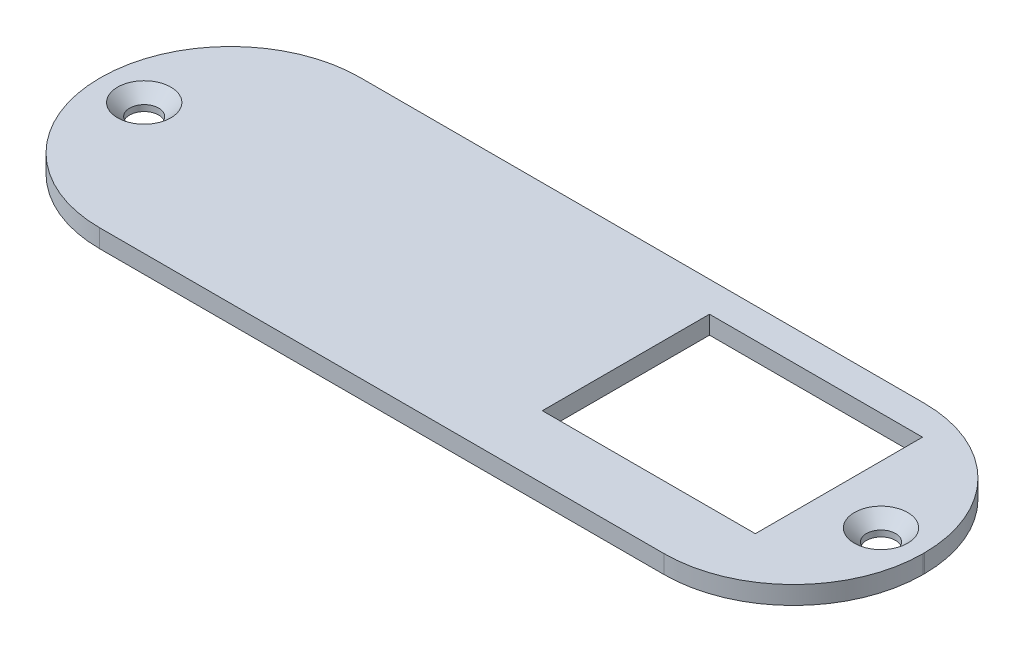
ISO-10303-21;
HEADER;
FILE_DESCRIPTION(('STEP AP214'),'2;1');
FILE_NAME('part.step','',(''),(''),'','','');
FILE_SCHEMA(('AUTOMOTIVE_DESIGN { 1 0 10303 214 1 1 1 1 }'));
ENDSEC;
DATA;
#1=APPLICATION_CONTEXT('core data for automotive mechanical design processes');
#2=APPLICATION_PROTOCOL_DEFINITION('international standard','automotive_design',2000,#1);
#3=PRODUCT_CONTEXT('',#1,'mechanical');
#4=PRODUCT('Part','Part','',(#3));
#5=PRODUCT_RELATED_PRODUCT_CATEGORY('part','',(#4));
#6=PRODUCT_DEFINITION_FORMATION('','',#4);
#7=PRODUCT_DEFINITION_CONTEXT('part definition',#1,'design');
#8=PRODUCT_DEFINITION('design','',#6,#7);
#9=PRODUCT_DEFINITION_SHAPE('','',#8);
#10=(LENGTH_UNIT() NAMED_UNIT(*) SI_UNIT(.MILLI.,.METRE.));
#11=(NAMED_UNIT(*) PLANE_ANGLE_UNIT() SI_UNIT($,.RADIAN.));
#12=(NAMED_UNIT(*) SI_UNIT($,.STERADIAN.) SOLID_ANGLE_UNIT());
#13=UNCERTAINTY_MEASURE_WITH_UNIT(LENGTH_MEASURE(1.E-05),#10,'distance_accuracy_value','');
#14=(GEOMETRIC_REPRESENTATION_CONTEXT(3) GLOBAL_UNCERTAINTY_ASSIGNED_CONTEXT((#13)) GLOBAL_UNIT_ASSIGNED_CONTEXT((#10,
#11,#12)) REPRESENTATION_CONTEXT('',''));
#15=CARTESIAN_POINT('',(0.,0.,0.));
#16=DIRECTION('',(0.,0.,1.));
#17=DIRECTION('',(1.,0.,0.));
#18=AXIS2_PLACEMENT_3D('',#15,#16,#17);
#19=CARTESIAN_POINT('',(10.7,1.5,-10.7));
#20=DIRECTION('',(0.,-1.,0.));
#21=DIRECTION('',(0.,0.,-1.));
#22=AXIS2_PLACEMENT_3D('',#19,#20,#21);
#23=CYLINDRICAL_SURFACE('',#22,10.7);
#24=CARTESIAN_POINT('',(10.7,0.,-10.7));
#25=DIRECTION('',(0.,1.,0.));
#26=DIRECTION('',(0.,0.,-1.));
#27=AXIS2_PLACEMENT_3D('',#24,#25,#26);
#28=CIRCLE('',#27,10.7);
#29=CARTESIAN_POINT('',(0.,0.,-10.7000000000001));
#30=VERTEX_POINT('',#29);
#31=CARTESIAN_POINT('',(10.7000000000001,0.,0.));
#32=VERTEX_POINT('',#31);
#33=EDGE_CURVE('E199',#30,#32,#28,.T.);
#34=ORIENTED_EDGE('',*,*,#33,.T.);
#35=DIRECTION('',(0.,-1.,0.));
#36=VECTOR('',#35,1.);
#37=CARTESIAN_POINT('',(10.7000000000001,1.5,0.));
#38=LINE('',#37,#36);
#39=CARTESIAN_POINT('',(10.7000000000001,1.5,0.));
#40=VERTEX_POINT('',#39);
#41=EDGE_CURVE('E11',#40,#32,#38,.T.);
#42=ORIENTED_EDGE('',*,*,#41,.F.);
#43=CARTESIAN_POINT('',(10.7,1.5,-10.7));
#44=DIRECTION('',(0.,1.,0.));
#45=DIRECTION('',(0.,0.,-1.));
#46=AXIS2_PLACEMENT_3D('',#43,#44,#45);
#47=CIRCLE('',#46,10.7);
#48=CARTESIAN_POINT('',(0.,1.5,-10.7000000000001));
#49=VERTEX_POINT('',#48);
#50=EDGE_CURVE('E200',#49,#40,#47,.T.);
#51=ORIENTED_EDGE('',*,*,#50,.F.);
#52=DIRECTION('',(0.,-1.,0.));
#53=VECTOR('',#52,1.);
#54=CARTESIAN_POINT('',(0.,1.5,-10.7000000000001));
#55=LINE('',#54,#53);
#56=EDGE_CURVE('E226',#49,#30,#55,.T.);
#57=ORIENTED_EDGE('',*,*,#56,.T.);
#58=EDGE_LOOP('',(#34,#42,#51,#57));
#59=FACE_BOUND('',#58,.T.);
#60=ADVANCED_FACE('F38',(#59),#23,.T.);
#61=CARTESIAN_POINT('',(10.7000000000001,1.5,0.));
#62=DIRECTION('',(0.,0.,-1.));
#63=DIRECTION('',(-1.,0.,0.));
#64=AXIS2_PLACEMENT_3D('',#61,#62,#63);
#65=PLANE('',#64);
#66=DIRECTION('',(1.,0.,0.));
#67=VECTOR('',#66,1.);
#68=CARTESIAN_POINT('',(10.7000000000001,0.,0.));
#69=LINE('',#68,#67);
#70=CARTESIAN_POINT('',(57.2999999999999,0.,0.));
#71=VERTEX_POINT('',#70);
#72=EDGE_CURVE('E230',#32,#71,#69,.T.);
#73=ORIENTED_EDGE('',*,*,#72,.T.);
#74=DIRECTION('',(0.,-1.,0.));
#75=VECTOR('',#74,1.);
#76=CARTESIAN_POINT('',(57.2999999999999,1.5,0.));
#77=LINE('',#76,#75);
#78=CARTESIAN_POINT('',(57.2999999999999,1.5,0.));
#79=VERTEX_POINT('',#78);
#80=EDGE_CURVE('E46',#79,#71,#77,.T.);
#81=ORIENTED_EDGE('',*,*,#80,.F.);
#82=DIRECTION('',(1.,0.,0.));
#83=VECTOR('',#82,1.);
#84=CARTESIAN_POINT('',(10.7000000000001,1.5,0.));
#85=LINE('',#84,#83);
#86=EDGE_CURVE('E204',#40,#79,#85,.T.);
#87=ORIENTED_EDGE('',*,*,#86,.F.);
#88=ORIENTED_EDGE('',*,*,#41,.T.);
#89=EDGE_LOOP('',(#73,#81,#87,#88));
#90=FACE_BOUND('',#89,.T.);
#91=ADVANCED_FACE('F300',(#90),#65,.F.);
#92=CARTESIAN_POINT('',(57.3,1.5,-10.7));
#93=DIRECTION('',(0.,-1.,0.));
#94=DIRECTION('',(0.,0.,-1.));
#95=AXIS2_PLACEMENT_3D('',#92,#93,#94);
#96=CYLINDRICAL_SURFACE('',#95,10.7);
#97=CARTESIAN_POINT('',(57.3,0.,-10.7));
#98=DIRECTION('',(0.,1.,0.));
#99=DIRECTION('',(0.,0.,1.));
#100=AXIS2_PLACEMENT_3D('',#97,#98,#99);
#101=CIRCLE('',#100,10.7);
#102=CARTESIAN_POINT('',(68.,0.,-10.7000000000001));
#103=VERTEX_POINT('',#102);
#104=EDGE_CURVE('E233',#71,#103,#101,.T.);
#105=ORIENTED_EDGE('',*,*,#104,.T.);
#106=DIRECTION('',(0.,-1.,0.));
#107=VECTOR('',#106,1.);
#108=CARTESIAN_POINT('',(68.,1.5,-10.7000000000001));
#109=LINE('',#108,#107);
#110=CARTESIAN_POINT('',(68.,1.5,-10.7000000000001));
#111=VERTEX_POINT('',#110);
#112=EDGE_CURVE('E269',#111,#103,#109,.T.);
#113=ORIENTED_EDGE('',*,*,#112,.F.);
#114=CARTESIAN_POINT('',(57.3,1.5,-10.7));
#115=DIRECTION('',(0.,1.,0.));
#116=DIRECTION('',(0.,0.,1.));
#117=AXIS2_PLACEMENT_3D('',#114,#115,#116);
#118=CIRCLE('',#117,10.7);
#119=EDGE_CURVE('E208',#79,#111,#118,.T.);
#120=ORIENTED_EDGE('',*,*,#119,.F.);
#121=ORIENTED_EDGE('',*,*,#80,.T.);
#122=EDGE_LOOP('',(#105,#113,#120,#121));
#123=FACE_BOUND('',#122,.T.);
#124=ADVANCED_FACE('F278',(#123),#96,.T.);
#125=CARTESIAN_POINT('',(68.,1.5,-10.7000000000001));
#126=DIRECTION('',(-1.,0.,0.));
#127=DIRECTION('',(0.,0.,1.));
#128=AXIS2_PLACEMENT_3D('',#125,#126,#127);
#129=PLANE('',#128);
#130=DIRECTION('',(0.,0.,-1.));
#131=VECTOR('',#130,1.);
#132=CARTESIAN_POINT('',(68.,0.,-10.7000000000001));
#133=LINE('',#132,#131);
#134=CARTESIAN_POINT('',(68.,0.,-10.7999999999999));
#135=VERTEX_POINT('',#134);
#136=EDGE_CURVE('E236',#103,#135,#133,.T.);
#137=ORIENTED_EDGE('',*,*,#136,.T.);
#138=DIRECTION('',(0.,-1.,0.));
#139=VECTOR('',#138,1.);
#140=CARTESIAN_POINT('',(68.,1.5,-10.7999999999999));
#141=LINE('',#140,#139);
#142=CARTESIAN_POINT('',(68.,1.5,-10.7999999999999));
#143=VERTEX_POINT('',#142);
#144=EDGE_CURVE('E265',#143,#135,#141,.T.);
#145=ORIENTED_EDGE('',*,*,#144,.F.);
#146=DIRECTION('',(0.,0.,-1.));
#147=VECTOR('',#146,1.);
#148=CARTESIAN_POINT('',(68.,1.5,-10.7000000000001));
#149=LINE('',#148,#147);
#150=EDGE_CURVE('E211',#111,#143,#149,.T.);
#151=ORIENTED_EDGE('',*,*,#150,.F.);
#152=ORIENTED_EDGE('',*,*,#112,.T.);
#153=EDGE_LOOP('',(#137,#145,#151,#152));
#154=FACE_BOUND('',#153,.T.);
#155=ADVANCED_FACE('F288',(#154),#129,.F.);
#156=CARTESIAN_POINT('',(57.3,1.5,-10.8));
#157=DIRECTION('',(0.,-1.,0.));
#158=DIRECTION('',(0.,0.,-1.));
#159=AXIS2_PLACEMENT_3D('',#156,#157,#158);
#160=CYLINDRICAL_SURFACE('',#159,10.7);
#161=CARTESIAN_POINT('',(57.3,0.,-10.8));
#162=DIRECTION('',(0.,1.,0.));
#163=DIRECTION('',(0.,0.,-1.));
#164=AXIS2_PLACEMENT_3D('',#161,#162,#163);
#165=CIRCLE('',#164,10.7);
#166=CARTESIAN_POINT('',(57.2999999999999,0.,-21.5));
#167=VERTEX_POINT('',#166);
#168=EDGE_CURVE('E239',#135,#167,#165,.T.);
#169=ORIENTED_EDGE('',*,*,#168,.T.);
#170=DIRECTION('',(0.,-1.,0.));
#171=VECTOR('',#170,1.);
#172=CARTESIAN_POINT('',(57.2999999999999,1.5,-21.5));
#173=LINE('',#172,#171);
#174=CARTESIAN_POINT('',(57.2999999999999,1.5,-21.5));
#175=VERTEX_POINT('',#174);
#176=EDGE_CURVE('E261',#175,#167,#173,.T.);
#177=ORIENTED_EDGE('',*,*,#176,.F.);
#178=CARTESIAN_POINT('',(57.3,1.5,-10.8));
#179=DIRECTION('',(0.,1.,0.));
#180=DIRECTION('',(0.,0.,-1.));
#181=AXIS2_PLACEMENT_3D('',#178,#179,#180);
#182=CIRCLE('',#181,10.7);
#183=EDGE_CURVE('E214',#143,#175,#182,.T.);
#184=ORIENTED_EDGE('',*,*,#183,.F.);
#185=ORIENTED_EDGE('',*,*,#144,.T.);
#186=EDGE_LOOP('',(#169,#177,#184,#185));
#187=FACE_BOUND('',#186,.T.);
#188=ADVANCED_FACE('F292',(#187),#160,.T.);
#189=CARTESIAN_POINT('',(10.7000000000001,1.5,-21.5));
#190=DIRECTION('',(0.,0.,1.));
#191=DIRECTION('',(1.,0.,0.));
#192=AXIS2_PLACEMENT_3D('',#189,#190,#191);
#193=PLANE('',#192);
#194=DIRECTION('',(-1.,0.,0.));
#195=VECTOR('',#194,1.);
#196=CARTESIAN_POINT('',(10.7000000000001,0.,-21.5));
#197=LINE('',#196,#195);
#198=CARTESIAN_POINT('',(10.7000000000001,0.,-21.5));
#199=VERTEX_POINT('',#198);
#200=EDGE_CURVE('E242',#167,#199,#197,.T.);
#201=ORIENTED_EDGE('',*,*,#200,.T.);
#202=DIRECTION('',(0.,-1.,0.));
#203=VECTOR('',#202,1.);
#204=CARTESIAN_POINT('',(10.7000000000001,1.5,-21.5));
#205=LINE('',#204,#203);
#206=CARTESIAN_POINT('',(10.7000000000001,1.5,-21.5));
#207=VERTEX_POINT('',#206);
#208=EDGE_CURVE('E257',#207,#199,#205,.T.);
#209=ORIENTED_EDGE('',*,*,#208,.F.);
#210=DIRECTION('',(-1.,0.,0.));
#211=VECTOR('',#210,1.);
#212=CARTESIAN_POINT('',(10.7000000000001,1.5,-21.5));
#213=LINE('',#212,#211);
#214=EDGE_CURVE('E217',#175,#207,#213,.T.);
#215=ORIENTED_EDGE('',*,*,#214,.F.);
#216=ORIENTED_EDGE('',*,*,#176,.T.);
#217=EDGE_LOOP('',(#201,#209,#215,#216));
#218=FACE_BOUND('',#217,.T.);
#219=ADVANCED_FACE('F313',(#218),#193,.F.);
#220=CARTESIAN_POINT('',(10.7,1.5,-10.8));
#221=DIRECTION('',(0.,-1.,0.));
#222=DIRECTION('',(0.,0.,-1.));
#223=AXIS2_PLACEMENT_3D('',#220,#221,#222);
#224=CYLINDRICAL_SURFACE('',#223,10.7);
#225=CARTESIAN_POINT('',(10.7,0.,-10.8));
#226=DIRECTION('',(0.,1.,0.));
#227=DIRECTION('',(0.,0.,-1.));
#228=AXIS2_PLACEMENT_3D('',#225,#226,#227);
#229=CIRCLE('',#228,10.7);
#230=CARTESIAN_POINT('',(0.,0.,-10.7999999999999));
#231=VERTEX_POINT('',#230);
#232=EDGE_CURVE('E245',#199,#231,#229,.T.);
#233=ORIENTED_EDGE('',*,*,#232,.T.);
#234=DIRECTION('',(0.,-1.,0.));
#235=VECTOR('',#234,1.);
#236=CARTESIAN_POINT('',(0.,1.5,-10.7999999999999));
#237=LINE('',#236,#235);
#238=CARTESIAN_POINT('',(0.,1.5,-10.7999999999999));
#239=VERTEX_POINT('',#238);
#240=EDGE_CURVE('E253',#239,#231,#237,.T.);
#241=ORIENTED_EDGE('',*,*,#240,.F.);
#242=CARTESIAN_POINT('',(10.7,1.5,-10.8));
#243=DIRECTION('',(0.,1.,0.));
#244=DIRECTION('',(0.,0.,-1.));
#245=AXIS2_PLACEMENT_3D('',#242,#243,#244);
#246=CIRCLE('',#245,10.7);
#247=EDGE_CURVE('E220',#207,#239,#246,.T.);
#248=ORIENTED_EDGE('',*,*,#247,.F.);
#249=ORIENTED_EDGE('',*,*,#208,.T.);
#250=EDGE_LOOP('',(#233,#241,#248,#249));
#251=FACE_BOUND('',#250,.T.);
#252=ADVANCED_FACE('F311',(#251),#224,.T.);
#253=CARTESIAN_POINT('',(0.,1.5,-10.7000000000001));
#254=DIRECTION('',(1.,0.,0.));
#255=DIRECTION('',(0.,0.,-1.));
#256=AXIS2_PLACEMENT_3D('',#253,#254,#255);
#257=PLANE('',#256);
#258=DIRECTION('',(0.,0.,1.));
#259=VECTOR('',#258,1.);
#260=CARTESIAN_POINT('',(0.,0.,-10.7000000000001));
#261=LINE('',#260,#259);
#262=EDGE_CURVE('E205',#231,#30,#261,.T.);
#263=ORIENTED_EDGE('',*,*,#262,.T.);
#264=ORIENTED_EDGE('',*,*,#56,.F.);
#265=DIRECTION('',(0.,0.,1.));
#266=VECTOR('',#265,1.);
#267=CARTESIAN_POINT('',(0.,1.5,-10.7000000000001));
#268=LINE('',#267,#266);
#269=EDGE_CURVE('E223',#239,#49,#268,.T.);
#270=ORIENTED_EDGE('',*,*,#269,.F.);
#271=ORIENTED_EDGE('',*,*,#240,.T.);
#272=EDGE_LOOP('',(#263,#264,#270,#271));
#273=FACE_BOUND('',#272,.T.);
#274=ADVANCED_FACE('F306',(#273),#257,.F.);
#275=CARTESIAN_POINT('',(10.7,1.5,-10.7));
#276=DIRECTION('',(0.,-1.,0.));
#277=DIRECTION('',(0.,0.,-1.));
#278=AXIS2_PLACEMENT_3D('',#275,#276,#277);
#279=PLANE('',#278);
#280=DIRECTION('',(-1.,0.,0.));
#281=VECTOR('',#280,1.);
#282=CARTESIAN_POINT('',(59.65,1.5,-19.));
#283=LINE('',#282,#281);
#284=CARTESIAN_POINT('',(59.65,1.5,-19.));
#285=VERTEX_POINT('',#284);
#286=CARTESIAN_POINT('',(42.0598584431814,1.5,-19.));
#287=VERTEX_POINT('',#286);
#288=EDGE_CURVE('E161',#285,#287,#283,.T.);
#289=ORIENTED_EDGE('',*,*,#288,.F.);
#290=DIRECTION('',(0.,0.,-1.));
#291=VECTOR('',#290,1.);
#292=CARTESIAN_POINT('',(59.65,1.5,-19.));
#293=LINE('',#292,#291);
#294=CARTESIAN_POINT('',(59.65,1.5,-5.19472370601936));
#295=VERTEX_POINT('',#294);
#296=EDGE_CURVE('E53',#295,#285,#293,.T.);
#297=ORIENTED_EDGE('',*,*,#296,.F.);
#298=DIRECTION('',(1.,0.,0.));
#299=VECTOR('',#298,1.);
#300=CARTESIAN_POINT('',(59.65,1.5,-5.19472370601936));
#301=LINE('',#300,#299);
#302=CARTESIAN_POINT('',(42.0598584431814,1.5,-5.19472370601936));
#303=VERTEX_POINT('',#302);
#304=EDGE_CURVE('E148',#303,#295,#301,.T.);
#305=ORIENTED_EDGE('',*,*,#304,.F.);
#306=DIRECTION('',(0.,0.,1.));
#307=VECTOR('',#306,1.);
#308=CARTESIAN_POINT('',(42.0598584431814,1.5,-19.));
#309=LINE('',#308,#307);
#310=EDGE_CURVE('E152',#287,#303,#309,.T.);
#311=ORIENTED_EDGE('',*,*,#310,.F.);
#312=EDGE_LOOP('',(#289,#297,#305,#311));
#313=FACE_BOUND('',#312,.T.);
#314=CARTESIAN_POINT('',(3.57803634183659,1.5,-10.7999999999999));
#315=DIRECTION('',(0.,1.,0.));
#316=DIRECTION('',(0.,0.,1.));
#317=AXIS2_PLACEMENT_3D('',#314,#315,#316);
#318=CIRCLE('',#317,2.2);
#319=CARTESIAN_POINT('',(3.57803634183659,1.5,-8.59999999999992));
#320=VERTEX_POINT('',#319);
#321=EDGE_CURVE('E170',#320,#320,#318,.T.);
#322=ORIENTED_EDGE('',*,*,#321,.F.);
#323=EDGE_LOOP('',(#322));
#324=FACE_BOUND('',#323,.T.);
#325=CARTESIAN_POINT('',(64.42357397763,1.5,-10.7999999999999));
#326=DIRECTION('',(0.,1.,0.));
#327=DIRECTION('',(0.,0.,1.));
#328=AXIS2_PLACEMENT_3D('',#325,#326,#327);
#329=CIRCLE('',#328,2.19999999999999);
#330=CARTESIAN_POINT('',(64.42357397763,1.5,-8.59999999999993));
#331=VERTEX_POINT('',#330);
#332=EDGE_CURVE('E187',#331,#331,#329,.T.);
#333=ORIENTED_EDGE('',*,*,#332,.F.);
#334=EDGE_LOOP('',(#333));
#335=FACE_BOUND('',#334,.T.);
#336=ORIENTED_EDGE('',*,*,#50,.T.);
#337=ORIENTED_EDGE('',*,*,#86,.T.);
#338=ORIENTED_EDGE('',*,*,#119,.T.);
#339=ORIENTED_EDGE('',*,*,#150,.T.);
#340=ORIENTED_EDGE('',*,*,#183,.T.);
#341=ORIENTED_EDGE('',*,*,#214,.T.);
#342=ORIENTED_EDGE('',*,*,#247,.T.);
#343=ORIENTED_EDGE('',*,*,#269,.T.);
#344=EDGE_LOOP('',(#336,#337,#338,#339,#340,#341,#342,#343));
#345=FACE_BOUND('',#344,.T.);
#346=ADVANCED_FACE('F296',(#313,#324,#335,#345),#279,.F.);
#347=CARTESIAN_POINT('',(10.7,0.,-10.7));
#348=DIRECTION('',(0.,-1.,0.));
#349=DIRECTION('',(0.,0.,-1.));
#350=AXIS2_PLACEMENT_3D('',#347,#348,#349);
#351=PLANE('',#350);
#352=DIRECTION('',(0.,0.,-1.));
#353=VECTOR('',#352,1.);
#354=CARTESIAN_POINT('',(59.65,0.,-19.));
#355=LINE('',#354,#353);
#356=CARTESIAN_POINT('',(59.65,0.,-5.19472370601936));
#357=VERTEX_POINT('',#356);
#358=CARTESIAN_POINT('',(59.65,0.,-19.));
#359=VERTEX_POINT('',#358);
#360=EDGE_CURVE('E129',#357,#359,#355,.T.);
#361=ORIENTED_EDGE('',*,*,#360,.T.);
#362=DIRECTION('',(-1.,0.,0.));
#363=VECTOR('',#362,1.);
#364=CARTESIAN_POINT('',(59.65,0.,-19.));
#365=LINE('',#364,#363);
#366=CARTESIAN_POINT('',(42.0598584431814,0.,-19.));
#367=VERTEX_POINT('',#366);
#368=EDGE_CURVE('E139',#359,#367,#365,.T.);
#369=ORIENTED_EDGE('',*,*,#368,.T.);
#370=DIRECTION('',(0.,0.,1.));
#371=VECTOR('',#370,1.);
#372=CARTESIAN_POINT('',(42.0598584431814,0.,-19.));
#373=LINE('',#372,#371);
#374=CARTESIAN_POINT('',(42.0598584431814,0.,-5.19472370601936));
#375=VERTEX_POINT('',#374);
#376=EDGE_CURVE('E61',#367,#375,#373,.T.);
#377=ORIENTED_EDGE('',*,*,#376,.T.);
#378=DIRECTION('',(1.,0.,0.));
#379=VECTOR('',#378,1.);
#380=CARTESIAN_POINT('',(59.65,0.,-5.19472370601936));
#381=LINE('',#380,#379);
#382=EDGE_CURVE('E136',#375,#357,#381,.T.);
#383=ORIENTED_EDGE('',*,*,#382,.T.);
#384=EDGE_LOOP('',(#361,#369,#377,#383));
#385=FACE_BOUND('',#384,.T.);
#386=CARTESIAN_POINT('',(3.57803634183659,0.,-10.7999999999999));
#387=DIRECTION('',(0.,1.,0.));
#388=DIRECTION('',(0.,0.,1.));
#389=AXIS2_PLACEMENT_3D('',#386,#387,#388);
#390=CIRCLE('',#389,1.2);
#391=CARTESIAN_POINT('',(3.57803634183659,0.,-9.59999999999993));
#392=VERTEX_POINT('',#391);
#393=EDGE_CURVE('E183',#392,#392,#390,.T.);
#394=ORIENTED_EDGE('',*,*,#393,.T.);
#395=EDGE_LOOP('',(#394));
#396=FACE_BOUND('',#395,.T.);
#397=CARTESIAN_POINT('',(64.42357397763,0.,-10.7999999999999));
#398=DIRECTION('',(0.,1.,0.));
#399=DIRECTION('',(0.,0.,1.));
#400=AXIS2_PLACEMENT_3D('',#397,#398,#399);
#401=CIRCLE('',#400,1.19999999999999);
#402=CARTESIAN_POINT('',(64.42357397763,0.,-9.59999999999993));
#403=VERTEX_POINT('',#402);
#404=EDGE_CURVE('E195',#403,#403,#401,.T.);
#405=ORIENTED_EDGE('',*,*,#404,.T.);
#406=EDGE_LOOP('',(#405));
#407=FACE_BOUND('',#406,.T.);
#408=ORIENTED_EDGE('',*,*,#33,.F.);
#409=ORIENTED_EDGE('',*,*,#262,.F.);
#410=ORIENTED_EDGE('',*,*,#232,.F.);
#411=ORIENTED_EDGE('',*,*,#200,.F.);
#412=ORIENTED_EDGE('',*,*,#168,.F.);
#413=ORIENTED_EDGE('',*,*,#136,.F.);
#414=ORIENTED_EDGE('',*,*,#104,.F.);
#415=ORIENTED_EDGE('',*,*,#72,.F.);
#416=EDGE_LOOP('',(#408,#409,#410,#411,#412,#413,#414,#415));
#417=FACE_BOUND('',#416,.T.);
#418=ADVANCED_FACE('F144',(#385,#396,#407,#417),#351,.T.);
#419=CARTESIAN_POINT('',(64.42357397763,1.5,-10.7999999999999));
#420=DIRECTION('',(0.,1.,0.));
#421=DIRECTION('',(0.,0.,1.));
#422=AXIS2_PLACEMENT_3D('',#419,#420,#421);
#423=CYLINDRICAL_SURFACE('',#422,1.19999999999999);
#424=ORIENTED_EDGE('',*,*,#404,.F.);
#425=EDGE_LOOP('',(#424));
#426=FACE_BOUND('',#425,.T.);
#427=CARTESIAN_POINT('',(64.42357397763,0.499999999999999,-10.7999999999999));
#428=DIRECTION('',(0.,1.,0.));
#429=DIRECTION('',(0.,0.,1.));
#430=AXIS2_PLACEMENT_3D('',#427,#428,#429);
#431=CIRCLE('',#430,1.19999999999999);
#432=CARTESIAN_POINT('',(64.42357397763,0.499999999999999,-9.59999999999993));
#433=VERTEX_POINT('',#432);
#434=EDGE_CURVE('E191',#433,#433,#431,.T.);
#435=ORIENTED_EDGE('',*,*,#434,.T.);
#436=EDGE_LOOP('',(#435));
#437=FACE_BOUND('',#436,.T.);
#438=ADVANCED_FACE('F365',(#426,#437),#423,.F.);
#439=CARTESIAN_POINT('',(64.42357397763,1.5,-10.7999999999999));
#440=DIRECTION('',(0.,1.,0.));
#441=DIRECTION('',(0.,0.,1.));
#442=AXIS2_PLACEMENT_3D('',#439,#440,#441);
#443=CONICAL_SURFACE('',#442,2.19999999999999,0.785398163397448);
#444=ORIENTED_EDGE('',*,*,#434,.F.);
#445=EDGE_LOOP('',(#444));
#446=FACE_BOUND('',#445,.T.);
#447=ORIENTED_EDGE('',*,*,#332,.T.);
#448=EDGE_LOOP('',(#447));
#449=FACE_BOUND('',#448,.T.);
#450=ADVANCED_FACE('F370',(#446,#449),#443,.F.);
#451=CARTESIAN_POINT('',(3.57803634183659,1.5,-10.7999999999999));
#452=DIRECTION('',(0.,1.,0.));
#453=DIRECTION('',(0.,0.,1.));
#454=AXIS2_PLACEMENT_3D('',#451,#452,#453);
#455=CYLINDRICAL_SURFACE('',#454,1.2);
#456=ORIENTED_EDGE('',*,*,#393,.F.);
#457=EDGE_LOOP('',(#456));
#458=FACE_BOUND('',#457,.T.);
#459=CARTESIAN_POINT('',(3.57803634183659,0.499999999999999,-10.7999999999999));
#460=DIRECTION('',(0.,1.,0.));
#461=DIRECTION('',(0.,0.,1.));
#462=AXIS2_PLACEMENT_3D('',#459,#460,#461);
#463=CIRCLE('',#462,1.2);
#464=CARTESIAN_POINT('',(3.57803634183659,0.499999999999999,-9.59999999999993));
#465=VERTEX_POINT('',#464);
#466=EDGE_CURVE('E179',#465,#465,#463,.T.);
#467=ORIENTED_EDGE('',*,*,#466,.T.);
#468=EDGE_LOOP('',(#467));
#469=FACE_BOUND('',#468,.T.);
#470=ADVANCED_FACE('F382',(#458,#469),#455,.F.);
#471=CARTESIAN_POINT('',(3.57803634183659,1.5,-10.7999999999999));
#472=DIRECTION('',(0.,1.,0.));
#473=DIRECTION('',(0.,0.,1.));
#474=AXIS2_PLACEMENT_3D('',#471,#472,#473);
#475=CONICAL_SURFACE('',#474,2.2,0.785398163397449);
#476=ORIENTED_EDGE('',*,*,#466,.F.);
#477=EDGE_LOOP('',(#476));
#478=FACE_BOUND('',#477,.T.);
#479=ORIENTED_EDGE('',*,*,#321,.T.);
#480=EDGE_LOOP('',(#479));
#481=FACE_BOUND('',#480,.T.);
#482=ADVANCED_FACE('F392',(#478,#481),#475,.F.);
#483=CARTESIAN_POINT('',(59.65,0.,-19.));
#484=DIRECTION('',(1.,0.,0.));
#485=DIRECTION('',(0.,0.,-1.));
#486=AXIS2_PLACEMENT_3D('',#483,#484,#485);
#487=PLANE('',#486);
#488=ORIENTED_EDGE('',*,*,#296,.T.);
#489=DIRECTION('',(0.,1.,0.));
#490=VECTOR('',#489,1.);
#491=CARTESIAN_POINT('',(59.65,0.,-19.));
#492=LINE('',#491,#490);
#493=EDGE_CURVE('E125',#359,#285,#492,.T.);
#494=ORIENTED_EDGE('',*,*,#493,.F.);
#495=ORIENTED_EDGE('',*,*,#360,.F.);
#496=DIRECTION('',(0.,1.,0.));
#497=VECTOR('',#496,1.);
#498=CARTESIAN_POINT('',(59.65,0.,-5.19472370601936));
#499=LINE('',#498,#497);
#500=EDGE_CURVE('E167',#357,#295,#499,.T.);
#501=ORIENTED_EDGE('',*,*,#500,.T.);
#502=EDGE_LOOP('',(#488,#494,#495,#501));
#503=FACE_BOUND('',#502,.T.);
#504=ADVANCED_FACE('F127',(#503),#487,.F.);
#505=CARTESIAN_POINT('',(59.65,0.,-5.19472370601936));
#506=DIRECTION('',(0.,0.,1.));
#507=DIRECTION('',(1.,0.,0.));
#508=AXIS2_PLACEMENT_3D('',#505,#506,#507);
#509=PLANE('',#508);
#510=ORIENTED_EDGE('',*,*,#304,.T.);
#511=ORIENTED_EDGE('',*,*,#500,.F.);
#512=ORIENTED_EDGE('',*,*,#382,.F.);
#513=DIRECTION('',(0.,1.,0.));
#514=VECTOR('',#513,1.);
#515=CARTESIAN_POINT('',(42.0598584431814,0.,-5.19472370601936));
#516=LINE('',#515,#514);
#517=EDGE_CURVE('E171',#375,#303,#516,.T.);
#518=ORIENTED_EDGE('',*,*,#517,.T.);
#519=EDGE_LOOP('',(#510,#511,#512,#518));
#520=FACE_BOUND('',#519,.T.);
#521=ADVANCED_FACE('F420',(#520),#509,.F.);
#522=CARTESIAN_POINT('',(42.0598584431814,0.,-19.));
#523=DIRECTION('',(-1.,0.,0.));
#524=DIRECTION('',(0.,0.,1.));
#525=AXIS2_PLACEMENT_3D('',#522,#523,#524);
#526=PLANE('',#525);
#527=ORIENTED_EDGE('',*,*,#310,.T.);
#528=ORIENTED_EDGE('',*,*,#517,.F.);
#529=ORIENTED_EDGE('',*,*,#376,.F.);
#530=DIRECTION('',(0.,1.,0.));
#531=VECTOR('',#530,1.);
#532=CARTESIAN_POINT('',(42.0598584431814,0.,-19.));
#533=LINE('',#532,#531);
#534=EDGE_CURVE('E135',#367,#287,#533,.T.);
#535=ORIENTED_EDGE('',*,*,#534,.T.);
#536=EDGE_LOOP('',(#527,#528,#529,#535));
#537=FACE_BOUND('',#536,.T.);
#538=ADVANCED_FACE('F429',(#537),#526,.F.);
#539=CARTESIAN_POINT('',(59.65,0.,-19.));
#540=DIRECTION('',(0.,0.,-1.));
#541=DIRECTION('',(-1.,0.,0.));
#542=AXIS2_PLACEMENT_3D('',#539,#540,#541);
#543=PLANE('',#542);
#544=ORIENTED_EDGE('',*,*,#288,.T.);
#545=ORIENTED_EDGE('',*,*,#534,.F.);
#546=ORIENTED_EDGE('',*,*,#368,.F.);
#547=ORIENTED_EDGE('',*,*,#493,.T.);
#548=EDGE_LOOP('',(#544,#545,#546,#547));
#549=FACE_BOUND('',#548,.T.);
#550=ADVANCED_FACE('F140',(#549),#543,.F.);
#551=CLOSED_SHELL('',(#60,#91,#124,#155,#188,#219,#252,#274,#346,#418,#438,#450,#470,#482,#504,
#521,#538,#550));
#552=MANIFOLD_SOLID_BREP('B2',#551);
#553=ADVANCED_BREP_SHAPE_REPRESENTATION('',(#18,#552),#14);
#554=SHAPE_DEFINITION_REPRESENTATION(#9,#553);
ENDSEC;
END-ISO-10303-21;
